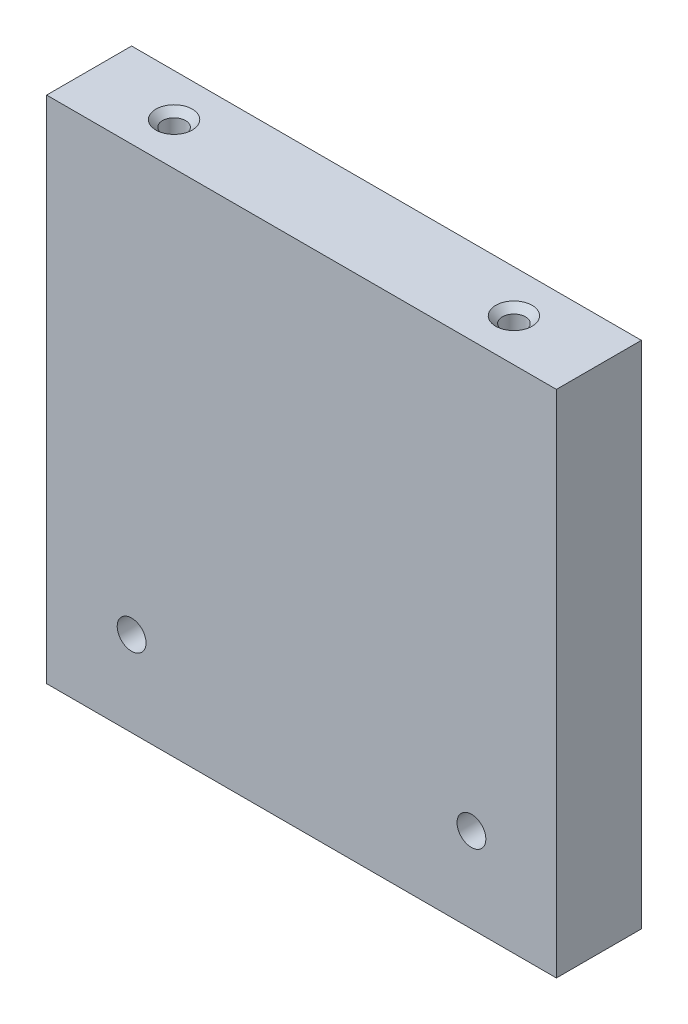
from build123d import *

# Parameters (mm, degrees)
SKETCH1_W                                     = 76.2
SKETCH1_H                                     = 76.2
BOSS_EXTRUDE1_DEPTH                           = 12.7
F_8_32_TAPPED_HOLE2_D                         = 3.4544
F_8_32_TAPPED_HOLE2_DEPTH                     = 6.35
F_8_32_TAPPED_HOLE2_CSINK_D                   = 5.4356
F_8_32_TAPPED_HOLE2_CSINK_ANGLE               = 90
F_8_32_TAPPED_HOLE2_TIP                       = 1.037806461
CBORE_FOR_8_SOCKET_HEAD_CAP_SCREW1_AT_2_COUNT = 2
CBORE_FOR_8_SOCKET_HEAD_CAP_SCREW1_AT_2_PITCH = 50.8


with BuildPart() as part:
    # Sketch1 → Boss-Extrude1 (new body)
    with BuildSketch(Plane.XY):
        with Locations((-45.510679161, 23.611267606)):
            Rectangle(SKETCH1_W, SKETCH1_H)
    extrude(amount=BOSS_EXTRUDE1_DEPTH)

    # 8-32 Tapped Hole2
    with Locations(Plane(origin=(0, 61.711267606, 0), x_dir=(1, 0, 0), z_dir=(0, 1, 0))):
        with Locations((-70.910679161, -6.35), (-20.110679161, -6.35)):
            CounterSinkHole(F_8_32_TAPPED_HOLE2_D / 2, F_8_32_TAPPED_HOLE2_CSINK_D / 2, depth=F_8_32_TAPPED_HOLE2_DEPTH, counter_sink_angle=F_8_32_TAPPED_HOLE2_CSINK_ANGLE)
            with Locations((0, 0, -(F_8_32_TAPPED_HOLE2_DEPTH + F_8_32_TAPPED_HOLE2_TIP / 2))):  # 118° drill point
                Cone(0, F_8_32_TAPPED_HOLE2_D / 2, F_8_32_TAPPED_HOLE2_TIP, mode=Mode.SUBTRACT)

    # Sketch8 → CBORE for _8 Socket Head Cap Screw1 (revolve, cut)
    with BuildSketch(Plane(origin=(-20.110679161, -1.788732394, 0), x_dir=(0, 1, 0), z_dir=(1, 0, 0))):
        Polygon((0, 0), (0, 12.7), (2.15265, 12.7), (2.15265, 4.1656), (3.96875, 4.1656), (3.96875, 0.635), (4.60375, 0), align=None)
    cbore_for_8_socket_head_cap_screw1 = revolve(axis=Axis((-20.110679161, -1.788732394, -6.35), (0, 0, 1)), mode=Mode.SUBTRACT)

    # CBORE for _8 Socket Head Cap Screw1 at 2: CBORE for _8 Socket Head Cap Screw1 ×2
    with Locations(*[(-i * CBORE_FOR_8_SOCKET_HEAD_CAP_SCREW1_AT_2_PITCH, 0, 0) for i in range(1, CBORE_FOR_8_SOCKET_HEAD_CAP_SCREW1_AT_2_COUNT)]):
        add(cbore_for_8_socket_head_cap_screw1, mode=Mode.SUBTRACT)


solid = part.part
